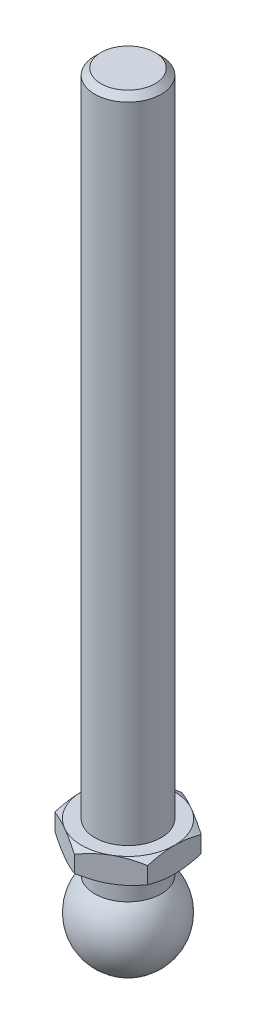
ISO-10303-21;
HEADER;
FILE_DESCRIPTION(('STEP AP214'),'2;1');
FILE_NAME('part.step','',(''),(''),'','','');
FILE_SCHEMA(('AUTOMOTIVE_DESIGN { 1 0 10303 214 1 1 1 1 }'));
ENDSEC;
DATA;
#1=APPLICATION_CONTEXT('core data for automotive mechanical design processes');
#2=APPLICATION_PROTOCOL_DEFINITION('international standard','automotive_design',2000,#1);
#3=PRODUCT_CONTEXT('',#1,'mechanical');
#4=PRODUCT('Part','Part','',(#3));
#5=PRODUCT_RELATED_PRODUCT_CATEGORY('part','',(#4));
#6=PRODUCT_DEFINITION_FORMATION('','',#4);
#7=PRODUCT_DEFINITION_CONTEXT('part definition',#1,'design');
#8=PRODUCT_DEFINITION('design','',#6,#7);
#9=PRODUCT_DEFINITION_SHAPE('','',#8);
#10=(LENGTH_UNIT() NAMED_UNIT(*) SI_UNIT(.MILLI.,.METRE.));
#11=(NAMED_UNIT(*) PLANE_ANGLE_UNIT() SI_UNIT($,.RADIAN.));
#12=(NAMED_UNIT(*) SI_UNIT($,.STERADIAN.) SOLID_ANGLE_UNIT());
#13=UNCERTAINTY_MEASURE_WITH_UNIT(LENGTH_MEASURE(1.E-05),#10,'distance_accuracy_value','');
#14=(GEOMETRIC_REPRESENTATION_CONTEXT(3) GLOBAL_UNCERTAINTY_ASSIGNED_CONTEXT((#13)) GLOBAL_UNIT_ASSIGNED_CONTEXT((#10,
#11,#12)) REPRESENTATION_CONTEXT('',''));
#15=CARTESIAN_POINT('',(0.,0.,0.));
#16=DIRECTION('',(0.,0.,1.));
#17=DIRECTION('',(1.,0.,0.));
#18=AXIS2_PLACEMENT_3D('',#15,#16,#17);
#19=CARTESIAN_POINT('',(0.,12.25,0.));
#20=DIRECTION('',(0.,-1.,0.));
#21=DIRECTION('',(0.,0.,-1.));
#22=AXIS2_PLACEMENT_3D('',#19,#20,#21);
#23=CONICAL_SURFACE('',#22,7.,1.0471975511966);
#24=CARTESIAN_POINT('',(-7.,8.18828268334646,12.1648696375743));
#25=CARTESIAN_POINT('',(-7.,8.33391573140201,11.8738003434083));
#26=CARTESIAN_POINT('',(-7.,8.47854589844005,11.5822239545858));
#27=CARTESIAN_POINT('',(-7.,8.76531569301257,10.997825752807));
#28=CARTESIAN_POINT('',(-7.,8.90745515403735,10.7050038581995));
#29=CARTESIAN_POINT('',(-7.,9.18902214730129,10.1173316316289));
#30=CARTESIAN_POINT('',(-7.,9.32844364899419,9.82247840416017));
#31=CARTESIAN_POINT('',(-7.,9.6036060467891,9.23106328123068));
#32=CARTESIAN_POINT('',(-7.,9.73934701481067,8.93450141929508));
#33=CARTESIAN_POINT('',(-7.,10.0123110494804,8.32593520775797));
#34=CARTESIAN_POINT('',(-7.,10.1493254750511,8.01383696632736));
#35=CARTESIAN_POINT('',(-7.,10.4171383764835,7.38695797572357));
#36=CARTESIAN_POINT('',(-7.,10.5479365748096,7.07217710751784));
#37=CARTESIAN_POINT('',(-7.,10.8015530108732,6.43962449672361));
#38=CARTESIAN_POINT('',(-7.,10.924376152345,6.12185473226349));
#39=CARTESIAN_POINT('',(-7.,11.1599016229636,5.48260317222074));
#40=CARTESIAN_POINT('',(-7.,11.2726050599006,5.16112178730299));
#41=CARTESIAN_POINT('',(-7.,11.5099014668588,4.43821731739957));
#42=CARTESIAN_POINT('',(-7.,11.631118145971,4.03566892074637));
#43=CARTESIAN_POINT('',(-7.,11.8469740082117,3.22331060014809));
#44=CARTESIAN_POINT('',(-7.,11.9416155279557,2.81350131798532));
#45=CARTESIAN_POINT('',(-7.,12.0569999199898,2.19742561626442));
#46=CARTESIAN_POINT('',(-7.,12.0908518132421,1.99359214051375));
#47=CARTESIAN_POINT('',(-7.,12.1493191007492,1.58461613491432));
#48=CARTESIAN_POINT('',(-7.,12.1739358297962,1.3794737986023));
#49=CARTESIAN_POINT('',(-7.,12.2131968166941,0.968289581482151));
#50=CARTESIAN_POINT('',(-7.,12.2278439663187,0.762247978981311));
#51=CARTESIAN_POINT('',(-7.,12.2467021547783,0.34968332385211));
#52=CARTESIAN_POINT('',(-7.,12.2509132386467,0.143160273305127));
#53=CARTESIAN_POINT('',(-7.,12.2487493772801,-0.27108276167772));
#54=CARTESIAN_POINT('',(-7.,12.2423100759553,-0.478802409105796));
#55=CARTESIAN_POINT('',(-7.,12.2189433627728,-0.89364512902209));
#56=CARTESIAN_POINT('',(-7.,12.2020159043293,-1.10076819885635));
#57=CARTESIAN_POINT('',(-7.,12.1582124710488,-1.51403043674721));
#58=CARTESIAN_POINT('',(-7.,12.1313327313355,-1.72016920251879));
#59=CARTESIAN_POINT('',(-7.,12.0684180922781,-2.13103319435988));
#60=CARTESIAN_POINT('',(-7.,12.0323828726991,-2.33575837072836));
#61=CARTESIAN_POINT('',(-7.,11.9105686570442,-2.95437912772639));
#62=CARTESIAN_POINT('',(-7.,11.8118729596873,-3.36575077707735));
#63=CARTESIAN_POINT('',(-7.,11.58845338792,-4.18138012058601));
#64=CARTESIAN_POINT('',(-7.,11.4637148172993,-4.58563365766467));
#65=CARTESIAN_POINT('',(-7.,11.2233248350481,-5.30320893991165));
#66=CARTESIAN_POINT('',(-7.,11.1112875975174,-5.61775957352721));
#67=CARTESIAN_POINT('',(-7.,10.8778514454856,-6.2432502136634));
#68=CARTESIAN_POINT('',(-7.,10.7564551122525,-6.55419118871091));
#69=CARTESIAN_POINT('',(-7.,10.5062070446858,-7.1732852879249));
#70=CARTESIAN_POINT('',(-7.,10.3773503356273,-7.4814363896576));
#71=CARTESIAN_POINT('',(-7.,10.1137823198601,-8.09523802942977));
#72=CARTESIAN_POINT('',(-7.,9.97907065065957,-8.4008884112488));
#73=CARTESIAN_POINT('',(-7.,9.71078407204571,-8.9971634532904));
#74=CARTESIAN_POINT('',(-7.,9.57740317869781,-9.28787568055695));
#75=CARTESIAN_POINT('',(-7.,9.30714715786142,-9.86766295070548));
#76=CARTESIAN_POINT('',(-7.,9.17027208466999,-10.1567380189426));
#77=CARTESIAN_POINT('',(-7.,8.89389786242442,-10.7329937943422));
#78=CARTESIAN_POINT('',(-7.,8.75440383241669,-11.0201769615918));
#79=CARTESIAN_POINT('',(-7.,8.47302286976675,-11.5933594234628));
#80=CARTESIAN_POINT('',(-7.,8.33113600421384,-11.879358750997));
#81=CARTESIAN_POINT('',(-7.,8.18828268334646,-12.1648696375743));
#82=B_SPLINE_CURVE_WITH_KNOTS('',3,(#24,#25,#26,#27,#28,#29,#30,#31,#32,#33,#34,#35,#36,#37,#38,
#39,#40,#41,#42,#43,#44,#45,#46,#47,#48,#49,#50,#51,#52,#53,#54,#55,#56,#57,#58,#59,#60,#61,#62,
#63,#64,#65,#66,#67,#68,#69,#70,#71,#72,#73,#74,#75,#76,#77,#78,#79,#80,#81),.UNSPECIFIED.,.F.,
.F.,(4,2,2,2,2,2,2,2,2,2,2,2,2,2,2,2,2,2,2,2,2,2,2,2,2,2,2,2,4),(0.,0.976413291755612,
1.95289161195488,2.93133423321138,3.90975772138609,4.93225217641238,5.95479223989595,
6.97669748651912,7.99849072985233,9.25906449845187,10.519527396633,11.1392271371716,
11.7588372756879,12.3782676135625,12.9976952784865,13.6208795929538,14.2440666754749,
14.8674897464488,15.4909346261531,16.7587972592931,18.0273773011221,19.0289263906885,
20.0302002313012,21.0321496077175,22.0341611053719,22.9936838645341,23.9531917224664,
24.9109871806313,25.8687558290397),.UNSPECIFIED.);
#83=CARTESIAN_POINT('',(-7.,11.6247852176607,4.04145188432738));
#84=VERTEX_POINT('',#83);
#85=CARTESIAN_POINT('',(-7.,12.25,0.));
#86=VERTEX_POINT('',#85);
#87=EDGE_CURVE('E312',#84,#86,#82,.T.);
#88=ORIENTED_EDGE('',*,*,#87,.F.);
#89=CARTESIAN_POINT('',(0.0002,11.6247185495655,8.0830192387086));
#90=CARTESIAN_POINT('',(-0.153667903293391,11.6760001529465,7.99418356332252));
#91=CARTESIAN_POINT('',(-0.30810950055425,11.7249544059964,7.90501666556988));
#92=CARTESIAN_POINT('',(-0.618246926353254,11.8175672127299,7.72595873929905));
#93=CARTESIAN_POINT('',(-0.773943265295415,11.8612234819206,7.63606741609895));
#94=CARTESIAN_POINT('',(-1.24352516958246,11.9833884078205,7.36495417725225));
#95=CARTESIAN_POINT('',(-1.5592643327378,12.052874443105,7.18266208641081));
#96=CARTESIAN_POINT('',(-2.03176224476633,12.1343550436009,6.9098652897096));
#97=CARTESIAN_POINT('',(-2.18710922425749,12.1575665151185,6.82017566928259));
#98=CARTESIAN_POINT('',(-2.49850511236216,12.1964887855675,6.64039116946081));
#99=CARTESIAN_POINT('',(-2.65455395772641,12.2122002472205,6.55029632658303));
#100=CARTESIAN_POINT('',(-2.96692267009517,12.2357220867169,6.36995016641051));
#101=CARTESIAN_POINT('',(-3.12324202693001,12.2435414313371,6.27969914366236));
#102=CARTESIAN_POINT('',(-3.43601650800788,12.2511197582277,6.09911871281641));
#103=CARTESIAN_POINT('',(-3.59247162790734,12.250878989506,6.00878930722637));
#104=CARTESIAN_POINT('',(-4.02110687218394,12.2391402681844,5.76131663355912));
#105=CARTESIAN_POINT('',(-4.2931466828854,12.2194342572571,5.60425437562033));
#106=CARTESIAN_POINT('',(-4.8354194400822,12.1569465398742,5.29117305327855));
#107=CARTESIAN_POINT('',(-5.10565047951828,12.114143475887,5.13515508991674));
#108=CARTESIAN_POINT('',(-5.64901454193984,12.0071483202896,4.82144370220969));
#109=CARTESIAN_POINT('',(-5.92207900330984,11.9425029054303,4.66378986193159));
#110=CARTESIAN_POINT('',(-6.46413578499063,11.795783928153,4.35083323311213));
#111=CARTESIAN_POINT('',(-6.73313504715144,11.7137448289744,4.19552643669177));
#112=CARTESIAN_POINT('',(-7.0002,11.6247185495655,4.04133641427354));
#113=B_SPLINE_CURVE_WITH_KNOTS('',3,(#89,#90,#91,#92,#93,#94,#95,#96,#97,#98,#99,#100,#101,#102,
#103,#104,#105,#106,#107,#108,#109,#110,#111,#112),.UNSPECIFIED.,.F.,.F.,(4,2,2,2,2,2,2,2,2,2,2,
4),(0.,0.554727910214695,1.10969417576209,2.2219327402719,2.76443041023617,3.30688013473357,
3.8487128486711,4.39052882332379,5.33376515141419,6.27787517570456,7.2429241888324,
8.20607866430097),.UNSPECIFIED.);
#114=CARTESIAN_POINT('',(-3.5,12.25,6.06217782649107));
#115=VERTEX_POINT('',#114);
#116=EDGE_CURVE('E138',#115,#84,#113,.T.);
#117=ORIENTED_EDGE('',*,*,#116,.F.);
#118=CARTESIAN_POINT('',(0.,12.25,0.));
#119=DIRECTION('',(0.,-1.,0.));
#120=DIRECTION('',(0.,0.,-1.));
#121=AXIS2_PLACEMENT_3D('',#118,#119,#120);
#122=CIRCLE('',#121,7.);
#123=EDGE_CURVE('E286',#115,#86,#122,.T.);
#124=ORIENTED_EDGE('',*,*,#123,.T.);
#125=EDGE_LOOP('',(#88,#117,#124));
#126=FACE_BOUND('',#125,.T.);
#127=ADVANCED_FACE('F17',(#126),#23,.T.);
#128=CARTESIAN_POINT('',(-7.,11.6247852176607,-4.04145188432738));
#129=VERTEX_POINT('',#128);
#130=EDGE_CURVE('E196',#86,#129,#82,.T.);
#131=ORIENTED_EDGE('',*,*,#130,.F.);
#132=CARTESIAN_POINT('',(-3.5,12.25,-6.06217782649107));
#133=VERTEX_POINT('',#132);
#134=EDGE_CURVE('E198',#86,#133,#122,.T.);
#135=ORIENTED_EDGE('',*,*,#134,.T.);
#136=CARTESIAN_POINT('',(-7.0002,11.6247185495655,-4.04133641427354));
#137=CARTESIAN_POINT('',(-6.84633209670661,11.6760001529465,-4.13017208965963));
#138=CARTESIAN_POINT('',(-6.69189049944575,11.7249544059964,-4.21933898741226));
#139=CARTESIAN_POINT('',(-6.38175307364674,11.8175672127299,-4.39839691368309));
#140=CARTESIAN_POINT('',(-6.22605673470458,11.8612234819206,-4.48828823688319));
#141=CARTESIAN_POINT('',(-5.75647483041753,11.9833884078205,-4.75940147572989));
#142=CARTESIAN_POINT('',(-5.4407356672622,12.052874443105,-4.94169356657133));
#143=CARTESIAN_POINT('',(-4.96823775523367,12.1343550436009,-5.21449036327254));
#144=CARTESIAN_POINT('',(-4.81289077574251,12.1575665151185,-5.30417998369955));
#145=CARTESIAN_POINT('',(-4.50149488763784,12.1964887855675,-5.48396448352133));
#146=CARTESIAN_POINT('',(-4.34544604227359,12.2122002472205,-5.57405932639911));
#147=CARTESIAN_POINT('',(-4.03307732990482,12.2357220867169,-5.75440548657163));
#148=CARTESIAN_POINT('',(-3.87675797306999,12.2435414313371,-5.84465650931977));
#149=CARTESIAN_POINT('',(-3.56398349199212,12.2511197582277,-6.02523694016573));
#150=CARTESIAN_POINT('',(-3.40752837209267,12.250878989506,-6.11556634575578));
#151=CARTESIAN_POINT('',(-2.97889312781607,12.2391402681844,-6.36303901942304));
#152=CARTESIAN_POINT('',(-2.7068533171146,12.2194342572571,-6.52010127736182));
#153=CARTESIAN_POINT('',(-2.1645805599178,12.1569465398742,-6.83318259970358));
#154=CARTESIAN_POINT('',(-1.89434952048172,12.114143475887,-6.9892005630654));
#155=CARTESIAN_POINT('',(-1.35098545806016,12.0071483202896,-7.30291195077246));
#156=CARTESIAN_POINT('',(-1.07792099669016,11.9425029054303,-7.46056579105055));
#157=CARTESIAN_POINT('',(-0.535864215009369,11.795783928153,-7.77352241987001));
#158=CARTESIAN_POINT('',(-0.266864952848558,11.7137448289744,-7.92882921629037));
#159=CARTESIAN_POINT('',(0.000200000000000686,11.6247185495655,-8.0830192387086));
#160=B_SPLINE_CURVE_WITH_KNOTS('',3,(#136,#137,#138,#139,#140,#141,#142,#143,#144,#145,#146,
#147,#148,#149,#150,#151,#152,#153,#154,#155,#156,#157,#158,#159),.UNSPECIFIED.,.F.,.F.,(4,2,2,
2,2,2,2,2,2,2,2,4),(0.,0.554727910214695,1.10969417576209,2.2219327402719,2.76443041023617,
3.30688013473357,3.8487128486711,4.39052882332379,5.33376515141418,6.27787517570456,
7.2429241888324,8.20607866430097),.UNSPECIFIED.);
#161=EDGE_CURVE('E186',#129,#133,#160,.T.);
#162=ORIENTED_EDGE('',*,*,#161,.F.);
#163=EDGE_LOOP('',(#131,#135,#162));
#164=FACE_BOUND('',#163,.T.);
#165=ADVANCED_FACE('F195',(#164),#23,.T.);
#166=CARTESIAN_POINT('',(0.,11.6247852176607,-8.08290376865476));
#167=VERTEX_POINT('',#166);
#168=EDGE_CURVE('E200',#133,#167,#160,.T.);
#169=ORIENTED_EDGE('',*,*,#168,.F.);
#170=CARTESIAN_POINT('',(3.5,12.25,-6.06217782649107));
#171=VERTEX_POINT('',#170);
#172=EDGE_CURVE('E296',#133,#171,#122,.T.);
#173=ORIENTED_EDGE('',*,*,#172,.T.);
#174=CARTESIAN_POINT('',(-0.0002,11.6247185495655,-8.0830192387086));
#175=CARTESIAN_POINT('',(0.153667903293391,11.6760001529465,-7.99418356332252));
#176=CARTESIAN_POINT('',(0.30810950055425,11.7249544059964,-7.90501666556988));
#177=CARTESIAN_POINT('',(0.618246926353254,11.8175672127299,-7.72595873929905));
#178=CARTESIAN_POINT('',(0.773943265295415,11.8612234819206,-7.63606741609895));
#179=CARTESIAN_POINT('',(1.24352516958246,11.9833884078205,-7.36495417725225));
#180=CARTESIAN_POINT('',(1.5592643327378,12.052874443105,-7.18266208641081));
#181=CARTESIAN_POINT('',(2.03176224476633,12.1343550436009,-6.9098652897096));
#182=CARTESIAN_POINT('',(2.18710922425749,12.1575665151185,-6.82017566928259));
#183=CARTESIAN_POINT('',(2.49850511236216,12.1964887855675,-6.64039116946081));
#184=CARTESIAN_POINT('',(2.65455395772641,12.2122002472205,-6.55029632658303));
#185=CARTESIAN_POINT('',(2.96692267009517,12.2357220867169,-6.36995016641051));
#186=CARTESIAN_POINT('',(3.12324202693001,12.2435414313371,-6.27969914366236));
#187=CARTESIAN_POINT('',(3.43601650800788,12.2511197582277,-6.09911871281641));
#188=CARTESIAN_POINT('',(3.59247162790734,12.250878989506,-6.00878930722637));
#189=CARTESIAN_POINT('',(4.02110687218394,12.2391402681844,-5.76131663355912));
#190=CARTESIAN_POINT('',(4.2931466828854,12.2194342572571,-5.60425437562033));
#191=CARTESIAN_POINT('',(4.8354194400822,12.1569465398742,-5.29117305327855));
#192=CARTESIAN_POINT('',(5.10565047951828,12.114143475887,-5.13515508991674));
#193=CARTESIAN_POINT('',(5.64901454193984,12.0071483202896,-4.82144370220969));
#194=CARTESIAN_POINT('',(5.92207900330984,11.9425029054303,-4.66378986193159));
#195=CARTESIAN_POINT('',(6.46413578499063,11.795783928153,-4.35083323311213));
#196=CARTESIAN_POINT('',(6.73313504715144,11.7137448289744,-4.19552643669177));
#197=CARTESIAN_POINT('',(7.0002,11.6247185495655,-4.04133641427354));
#198=B_SPLINE_CURVE_WITH_KNOTS('',3,(#174,#175,#176,#177,#178,#179,#180,#181,#182,#183,#184,
#185,#186,#187,#188,#189,#190,#191,#192,#193,#194,#195,#196,#197),.UNSPECIFIED.,.F.,.F.,(4,2,2,
2,2,2,2,2,2,2,2,4),(0.,0.554727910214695,1.10969417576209,2.2219327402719,2.76443041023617,
3.30688013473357,3.8487128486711,4.39052882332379,5.33376515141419,6.27787517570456,
7.2429241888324,8.20607866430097),.UNSPECIFIED.);
#199=EDGE_CURVE('E246',#167,#171,#198,.T.);
#200=ORIENTED_EDGE('',*,*,#199,.F.);
#201=EDGE_LOOP('',(#169,#173,#200));
#202=FACE_BOUND('',#201,.T.);
#203=ADVANCED_FACE('F345',(#202),#23,.T.);
#204=CARTESIAN_POINT('',(7.,11.6247852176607,-4.04145188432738));
#205=VERTEX_POINT('',#204);
#206=EDGE_CURVE('E241',#171,#205,#198,.T.);
#207=ORIENTED_EDGE('',*,*,#206,.F.);
#208=CARTESIAN_POINT('',(7.,12.25,0.));
#209=VERTEX_POINT('',#208);
#210=EDGE_CURVE('E291',#171,#209,#122,.T.);
#211=ORIENTED_EDGE('',*,*,#210,.T.);
#212=CARTESIAN_POINT('',(7.,8.18828268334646,-12.1648696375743));
#213=CARTESIAN_POINT('',(7.,8.33391573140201,-11.8738003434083));
#214=CARTESIAN_POINT('',(7.,8.47854589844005,-11.5822239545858));
#215=CARTESIAN_POINT('',(7.,8.76531569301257,-10.997825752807));
#216=CARTESIAN_POINT('',(7.,8.90745515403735,-10.7050038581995));
#217=CARTESIAN_POINT('',(7.,9.18902214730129,-10.1173316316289));
#218=CARTESIAN_POINT('',(7.,9.32844364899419,-9.82247840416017));
#219=CARTESIAN_POINT('',(7.,9.6036060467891,-9.23106328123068));
#220=CARTESIAN_POINT('',(7.,9.73934701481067,-8.93450141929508));
#221=CARTESIAN_POINT('',(7.,10.0123110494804,-8.32593520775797));
#222=CARTESIAN_POINT('',(7.,10.1493254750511,-8.01383696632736));
#223=CARTESIAN_POINT('',(7.,10.4171383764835,-7.38695797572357));
#224=CARTESIAN_POINT('',(7.,10.5479365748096,-7.07217710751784));
#225=CARTESIAN_POINT('',(7.,10.8015530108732,-6.43962449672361));
#226=CARTESIAN_POINT('',(7.,10.924376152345,-6.12185473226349));
#227=CARTESIAN_POINT('',(7.,11.1599016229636,-5.48260317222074));
#228=CARTESIAN_POINT('',(7.,11.2726050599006,-5.16112178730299));
#229=CARTESIAN_POINT('',(7.,11.5099014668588,-4.43821731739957));
#230=CARTESIAN_POINT('',(7.,11.631118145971,-4.03566892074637));
#231=CARTESIAN_POINT('',(7.,11.8469740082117,-3.22331060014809));
#232=CARTESIAN_POINT('',(7.,11.9416155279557,-2.81350131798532));
#233=CARTESIAN_POINT('',(7.,12.0569999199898,-2.19742561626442));
#234=CARTESIAN_POINT('',(7.,12.0908518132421,-1.99359214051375));
#235=CARTESIAN_POINT('',(7.,12.1493191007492,-1.58461613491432));
#236=CARTESIAN_POINT('',(7.,12.1739358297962,-1.3794737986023));
#237=CARTESIAN_POINT('',(7.,12.2131968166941,-0.968289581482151));
#238=CARTESIAN_POINT('',(7.,12.2278439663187,-0.762247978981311));
#239=CARTESIAN_POINT('',(7.,12.2467021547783,-0.34968332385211));
#240=CARTESIAN_POINT('',(7.,12.2509132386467,-0.143160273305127));
#241=CARTESIAN_POINT('',(7.,12.2487493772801,0.27108276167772));
#242=CARTESIAN_POINT('',(7.,12.2423100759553,0.478802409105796));
#243=CARTESIAN_POINT('',(7.,12.2189433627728,0.89364512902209));
#244=CARTESIAN_POINT('',(7.,12.2020159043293,1.10076819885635));
#245=CARTESIAN_POINT('',(7.,12.1582124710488,1.51403043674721));
#246=CARTESIAN_POINT('',(7.,12.1313327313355,1.72016920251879));
#247=CARTESIAN_POINT('',(7.,12.0684180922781,2.13103319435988));
#248=CARTESIAN_POINT('',(7.,12.0323828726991,2.33575837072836));
#249=CARTESIAN_POINT('',(7.,11.9105686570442,2.95437912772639));
#250=CARTESIAN_POINT('',(7.,11.8118729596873,3.36575077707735));
#251=CARTESIAN_POINT('',(7.,11.58845338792,4.18138012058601));
#252=CARTESIAN_POINT('',(7.,11.4637148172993,4.58563365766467));
#253=CARTESIAN_POINT('',(7.,11.2233248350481,5.30320893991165));
#254=CARTESIAN_POINT('',(7.,11.1112875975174,5.61775957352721));
#255=CARTESIAN_POINT('',(7.,10.8778514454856,6.2432502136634));
#256=CARTESIAN_POINT('',(7.,10.7564551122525,6.55419118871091));
#257=CARTESIAN_POINT('',(7.,10.5062070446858,7.1732852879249));
#258=CARTESIAN_POINT('',(7.,10.3773503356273,7.4814363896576));
#259=CARTESIAN_POINT('',(7.,10.1137823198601,8.09523802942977));
#260=CARTESIAN_POINT('',(7.,9.97907065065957,8.4008884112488));
#261=CARTESIAN_POINT('',(7.,9.71078407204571,8.9971634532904));
#262=CARTESIAN_POINT('',(7.,9.57740317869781,9.28787568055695));
#263=CARTESIAN_POINT('',(7.,9.30714715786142,9.86766295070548));
#264=CARTESIAN_POINT('',(7.,9.17027208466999,10.1567380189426));
#265=CARTESIAN_POINT('',(7.,8.89389786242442,10.7329937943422));
#266=CARTESIAN_POINT('',(7.,8.75440383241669,11.0201769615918));
#267=CARTESIAN_POINT('',(7.,8.47302286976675,11.5933594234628));
#268=CARTESIAN_POINT('',(7.,8.33113600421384,11.879358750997));
#269=CARTESIAN_POINT('',(7.,8.18828268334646,12.1648696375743));
#270=B_SPLINE_CURVE_WITH_KNOTS('',3,(#212,#213,#214,#215,#216,#217,#218,#219,#220,#221,#222,
#223,#224,#225,#226,#227,#228,#229,#230,#231,#232,#233,#234,#235,#236,#237,#238,#239,#240,#241,
#242,#243,#244,#245,#246,#247,#248,#249,#250,#251,#252,#253,#254,#255,#256,#257,#258,#259,#260,
#261,#262,#263,#264,#265,#266,#267,#268,#269),.UNSPECIFIED.,.F.,.F.,(4,2,2,2,2,2,2,2,2,2,2,2,2,
2,2,2,2,2,2,2,2,2,2,2,2,2,2,2,4),(0.,0.976413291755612,1.95289161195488,2.93133423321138,
3.90975772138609,4.93225217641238,5.95479223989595,6.97669748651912,7.99849072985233,
9.25906449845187,10.519527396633,11.1392271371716,11.7588372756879,12.3782676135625,
12.9976952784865,13.6208795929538,14.2440666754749,14.8674897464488,15.4909346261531,
16.7587972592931,18.0273773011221,19.0289263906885,20.0302002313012,21.0321496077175,
22.0341611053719,22.9936838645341,23.9531917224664,24.9109871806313,25.8687558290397),.UNSPECIFIED.);
#271=EDGE_CURVE('E252',#205,#209,#270,.T.);
#272=ORIENTED_EDGE('',*,*,#271,.F.);
#273=EDGE_LOOP('',(#207,#211,#272));
#274=FACE_BOUND('',#273,.T.);
#275=ADVANCED_FACE('F355',(#274),#23,.T.);
#276=CARTESIAN_POINT('',(7.,11.6247852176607,4.04145188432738));
#277=VERTEX_POINT('',#276);
#278=EDGE_CURVE('E254',#209,#277,#270,.T.);
#279=ORIENTED_EDGE('',*,*,#278,.F.);
#280=CARTESIAN_POINT('',(3.5,12.25,6.06217782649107));
#281=VERTEX_POINT('',#280);
#282=EDGE_CURVE('E284',#209,#281,#122,.T.);
#283=ORIENTED_EDGE('',*,*,#282,.T.);
#284=CARTESIAN_POINT('',(7.0002,11.6247185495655,4.04133641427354));
#285=CARTESIAN_POINT('',(6.84633209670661,11.6760001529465,4.13017208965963));
#286=CARTESIAN_POINT('',(6.69189049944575,11.7249544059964,4.21933898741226));
#287=CARTESIAN_POINT('',(6.38175307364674,11.8175672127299,4.39839691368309));
#288=CARTESIAN_POINT('',(6.22605673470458,11.8612234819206,4.48828823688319));
#289=CARTESIAN_POINT('',(5.75647483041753,11.9833884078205,4.75940147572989));
#290=CARTESIAN_POINT('',(5.4407356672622,12.052874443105,4.94169356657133));
#291=CARTESIAN_POINT('',(4.96823775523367,12.1343550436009,5.21449036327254));
#292=CARTESIAN_POINT('',(4.81289077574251,12.1575665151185,5.30417998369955));
#293=CARTESIAN_POINT('',(4.50149488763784,12.1964887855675,5.48396448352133));
#294=CARTESIAN_POINT('',(4.34544604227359,12.2122002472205,5.57405932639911));
#295=CARTESIAN_POINT('',(4.03307732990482,12.2357220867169,5.75440548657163));
#296=CARTESIAN_POINT('',(3.87675797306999,12.2435414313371,5.84465650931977));
#297=CARTESIAN_POINT('',(3.56398349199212,12.2511197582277,6.02523694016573));
#298=CARTESIAN_POINT('',(3.40752837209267,12.250878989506,6.11556634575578));
#299=CARTESIAN_POINT('',(2.97889312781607,12.2391402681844,6.36303901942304));
#300=CARTESIAN_POINT('',(2.7068533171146,12.2194342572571,6.52010127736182));
#301=CARTESIAN_POINT('',(2.1645805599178,12.1569465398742,6.83318259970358));
#302=CARTESIAN_POINT('',(1.89434952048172,12.114143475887,6.9892005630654));
#303=CARTESIAN_POINT('',(1.35098545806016,12.0071483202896,7.30291195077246));
#304=CARTESIAN_POINT('',(1.07792099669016,11.9425029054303,7.46056579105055));
#305=CARTESIAN_POINT('',(0.535864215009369,11.795783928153,7.77352241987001));
#306=CARTESIAN_POINT('',(0.266864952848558,11.7137448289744,7.92882921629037));
#307=CARTESIAN_POINT('',(-0.000200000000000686,11.6247185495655,8.0830192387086));
#308=B_SPLINE_CURVE_WITH_KNOTS('',3,(#284,#285,#286,#287,#288,#289,#290,#291,#292,#293,#294,
#295,#296,#297,#298,#299,#300,#301,#302,#303,#304,#305,#306,#307),.UNSPECIFIED.,.F.,.F.,(4,2,2,
2,2,2,2,2,2,2,2,4),(0.,0.554727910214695,1.10969417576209,2.2219327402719,2.76443041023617,
3.30688013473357,3.8487128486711,4.39052882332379,5.33376515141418,6.27787517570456,
7.2429241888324,8.20607866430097),.UNSPECIFIED.);
#309=EDGE_CURVE('E129',#277,#281,#308,.T.);
#310=ORIENTED_EDGE('',*,*,#309,.F.);
#311=EDGE_LOOP('',(#279,#283,#310));
#312=FACE_BOUND('',#311,.T.);
#313=ADVANCED_FACE('F288',(#312),#23,.T.);
#314=CARTESIAN_POINT('',(0.,11.6247852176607,8.08290376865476));
#315=VERTEX_POINT('',#314);
#316=EDGE_CURVE('E119',#281,#315,#308,.T.);
#317=ORIENTED_EDGE('',*,*,#316,.F.);
#318=EDGE_CURVE('E277',#281,#115,#122,.T.);
#319=ORIENTED_EDGE('',*,*,#318,.T.);
#320=EDGE_CURVE('E32',#315,#115,#113,.T.);
#321=ORIENTED_EDGE('',*,*,#320,.F.);
#322=EDGE_LOOP('',(#317,#319,#321));
#323=FACE_BOUND('',#322,.T.);
#324=ADVANCED_FACE('F276',(#323),#23,.T.);
#325=CARTESIAN_POINT('',(0.,110.25,0.));
#326=DIRECTION('',(0.,-1.,0.));
#327=DIRECTION('',(0.,0.,-1.));
#328=AXIS2_PLACEMENT_3D('',#325,#326,#327);
#329=PLANE('',#328);
#330=CARTESIAN_POINT('',(0.,110.25,0.));
#331=DIRECTION('',(0.,-1.,0.));
#332=DIRECTION('',(0.,0.,-1.));
#333=AXIS2_PLACEMENT_3D('',#330,#331,#332);
#334=CIRCLE('',#333,4.08);
#335=CARTESIAN_POINT('',(0.,110.25,-4.08));
#336=VERTEX_POINT('',#335);
#337=EDGE_CURVE('E25',#336,#336,#334,.T.);
#338=ORIENTED_EDGE('',*,*,#337,.F.);
#339=EDGE_LOOP('',(#338));
#340=FACE_BOUND('',#339,.T.);
#341=ADVANCED_FACE('F19',(#340),#329,.F.);
#342=CARTESIAN_POINT('',(0.,110.25,0.));
#343=DIRECTION('',(0.,-1.,0.));
#344=DIRECTION('',(0.,0.,-1.));
#345=AXIS2_PLACEMENT_3D('',#342,#343,#344);
#346=CONICAL_SURFACE('',#345,4.08,0.785398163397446);
#347=CARTESIAN_POINT('',(0.,109.33,0.));
#348=DIRECTION('',(0.,-1.,0.));
#349=DIRECTION('',(0.,0.,-1.));
#350=AXIS2_PLACEMENT_3D('',#347,#348,#349);
#351=CIRCLE('',#350,5.);
#352=CARTESIAN_POINT('',(0.,109.33,-5.));
#353=VERTEX_POINT('',#352);
#354=EDGE_CURVE('E293',#353,#353,#351,.T.);
#355=ORIENTED_EDGE('',*,*,#354,.F.);
#356=EDGE_LOOP('',(#355));
#357=FACE_BOUND('',#356,.T.);
#358=ORIENTED_EDGE('',*,*,#337,.T.);
#359=EDGE_LOOP('',(#358));
#360=FACE_BOUND('',#359,.T.);
#361=ADVANCED_FACE('F353',(#357,#360),#346,.T.);
#362=CARTESIAN_POINT('',(0.,-7.,0.));
#363=DIRECTION('',(0.,-1.,0.));
#364=DIRECTION('',(0.,0.,-1.));
#365=AXIS2_PLACEMENT_3D('',#362,#363,#364);
#366=CYLINDRICAL_SURFACE('',#365,5.);
#367=CARTESIAN_POINT('',(0.,12.25,0.));
#368=DIRECTION('',(0.,-1.,0.));
#369=DIRECTION('',(0.,0.,-1.));
#370=AXIS2_PLACEMENT_3D('',#367,#368,#369);
#371=CIRCLE('',#370,5.);
#372=CARTESIAN_POINT('',(0.,12.25,-5.));
#373=VERTEX_POINT('',#372);
#374=EDGE_CURVE('E290',#373,#373,#371,.T.);
#375=ORIENTED_EDGE('',*,*,#374,.F.);
#376=EDGE_LOOP('',(#375));
#377=FACE_BOUND('',#376,.T.);
#378=ORIENTED_EDGE('',*,*,#354,.T.);
#379=EDGE_LOOP('',(#378));
#380=FACE_BOUND('',#379,.T.);
#381=ADVANCED_FACE('F430',(#377,#380),#366,.T.);
#382=CARTESIAN_POINT('',(5.,12.25,0.));
#383=DIRECTION('',(0.,-1.,0.));
#384=DIRECTION('',(0.,0.,-1.));
#385=AXIS2_PLACEMENT_3D('',#382,#383,#384);
#386=PLANE('',#385);
#387=ORIENTED_EDGE('',*,*,#282,.F.);
#388=ORIENTED_EDGE('',*,*,#210,.F.);
#389=ORIENTED_EDGE('',*,*,#172,.F.);
#390=ORIENTED_EDGE('',*,*,#134,.F.);
#391=ORIENTED_EDGE('',*,*,#123,.F.);
#392=ORIENTED_EDGE('',*,*,#318,.F.);
#393=EDGE_LOOP('',(#387,#388,#389,#390,#391,#392));
#394=FACE_BOUND('',#393,.T.);
#395=ORIENTED_EDGE('',*,*,#374,.T.);
#396=EDGE_LOOP('',(#395));
#397=FACE_BOUND('',#396,.T.);
#398=ADVANCED_FACE('F281',(#394,#397),#386,.F.);
#399=CARTESIAN_POINT('',(-7.,8.5,-4.04145188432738));
#400=DIRECTION('',(-1.,0.,0.));
#401=DIRECTION('',(0.,0.,1.));
#402=AXIS2_PLACEMENT_3D('',#399,#400,#401);
#403=PLANE('',#402);
#404=ORIENTED_EDGE('',*,*,#87,.T.);
#405=ORIENTED_EDGE('',*,*,#130,.T.);
#406=DIRECTION('',(0.,1.,0.));
#407=VECTOR('',#406,1.);
#408=CARTESIAN_POINT('',(-7.,8.5,-4.04145188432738));
#409=LINE('',#408,#407);
#410=CARTESIAN_POINT('',(-7.,9.12521478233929,-4.04145188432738));
#411=VERTEX_POINT('',#410);
#412=EDGE_CURVE('E112',#411,#129,#409,.T.);
#413=ORIENTED_EDGE('',*,*,#412,.F.);
#414=CARTESIAN_POINT('',(-7.,12.5617173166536,-12.1648696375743));
#415=CARTESIAN_POINT('',(-7.,12.416084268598,-11.8738003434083));
#416=CARTESIAN_POINT('',(-7.,12.27145410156,-11.5822239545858));
#417=CARTESIAN_POINT('',(-7.,11.9846843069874,-10.997825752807));
#418=CARTESIAN_POINT('',(-7.,11.8425448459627,-10.7050038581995));
#419=CARTESIAN_POINT('',(-7.,11.5609778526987,-10.1173316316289));
#420=CARTESIAN_POINT('',(-7.,11.4215563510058,-9.82247840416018));
#421=CARTESIAN_POINT('',(-7.,11.1463939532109,-9.23106328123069));
#422=CARTESIAN_POINT('',(-7.,11.0106529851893,-8.93450141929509));
#423=CARTESIAN_POINT('',(-7.,10.7376889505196,-8.32593520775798));
#424=CARTESIAN_POINT('',(-7.,10.6006745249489,-8.01383696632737));
#425=CARTESIAN_POINT('',(-7.,10.3328616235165,-7.38695797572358));
#426=CARTESIAN_POINT('',(-7.,10.2020634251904,-7.07217710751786));
#427=CARTESIAN_POINT('',(-7.,9.94844698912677,-6.43962449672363));
#428=CARTESIAN_POINT('',(-7.,9.825623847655,-6.12185473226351));
#429=CARTESIAN_POINT('',(-7.,9.59009837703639,-5.48260317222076));
#430=CARTESIAN_POINT('',(-7.,9.47739494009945,-5.16112178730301));
#431=CARTESIAN_POINT('',(-7.,9.24009853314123,-4.4382173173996));
#432=CARTESIAN_POINT('',(-7.,9.11888185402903,-4.03566892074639));
#433=CARTESIAN_POINT('',(-7.,8.90302599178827,-3.22331060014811));
#434=CARTESIAN_POINT('',(-7.,8.80838447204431,-2.81350131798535));
#435=CARTESIAN_POINT('',(-7.,8.69300008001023,-2.19742561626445));
#436=CARTESIAN_POINT('',(-7.,8.65914818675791,-1.99359214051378));
#437=CARTESIAN_POINT('',(-7.,8.60068089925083,-1.58461613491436));
#438=CARTESIAN_POINT('',(-7.,8.5760641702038,-1.37947379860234));
#439=CARTESIAN_POINT('',(-7.,8.53680318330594,-0.968289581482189));
#440=CARTESIAN_POINT('',(-7.,8.52215603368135,-0.76224797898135));
#441=CARTESIAN_POINT('',(-7.,8.50329784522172,-0.349683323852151));
#442=CARTESIAN_POINT('',(-7.,8.49908676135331,-0.143160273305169));
#443=CARTESIAN_POINT('',(-7.,8.50125062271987,0.271082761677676));
#444=CARTESIAN_POINT('',(-7.,8.50768992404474,0.478802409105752));
#445=CARTESIAN_POINT('',(-7.,8.53105663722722,0.893645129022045));
#446=CARTESIAN_POINT('',(-7.,8.54798409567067,1.1007681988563));
#447=CARTESIAN_POINT('',(-7.,8.59178752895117,1.51403043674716));
#448=CARTESIAN_POINT('',(-7.,8.61866726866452,1.72016920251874));
#449=CARTESIAN_POINT('',(-7.,8.68158190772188,2.13103319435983));
#450=CARTESIAN_POINT('',(-7.,8.71761712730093,2.33575837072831));
#451=CARTESIAN_POINT('',(-7.,8.83943134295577,2.95437912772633));
#452=CARTESIAN_POINT('',(-7.,8.93812704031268,3.3657507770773));
#453=CARTESIAN_POINT('',(-7.,9.16154661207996,4.18138012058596));
#454=CARTESIAN_POINT('',(-7.,9.28628518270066,4.58563365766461));
#455=CARTESIAN_POINT('',(-7.,9.52667516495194,5.30320893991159));
#456=CARTESIAN_POINT('',(-7.,9.63871240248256,5.61775957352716));
#457=CARTESIAN_POINT('',(-7.,9.87214855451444,6.24325021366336));
#458=CARTESIAN_POINT('',(-7.,9.99354488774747,6.55419118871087));
#459=CARTESIAN_POINT('',(-7.,10.2437929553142,7.17328528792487));
#460=CARTESIAN_POINT('',(-7.,10.3726496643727,7.48143638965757));
#461=CARTESIAN_POINT('',(-7.,10.6362176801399,8.09523802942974));
#462=CARTESIAN_POINT('',(-7.,10.7709293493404,8.40088841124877));
#463=CARTESIAN_POINT('',(-7.,11.0392159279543,8.99716345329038));
#464=CARTESIAN_POINT('',(-7.,11.1725968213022,9.28787568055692));
#465=CARTESIAN_POINT('',(-7.,11.4428528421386,9.86766295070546));
#466=CARTESIAN_POINT('',(-7.,11.57972791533,10.1567380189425));
#467=CARTESIAN_POINT('',(-7.,11.8561021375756,10.7329937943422));
#468=CARTESIAN_POINT('',(-7.,11.9955961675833,11.0201769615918));
#469=CARTESIAN_POINT('',(-7.,12.2769771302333,11.5933594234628));
#470=CARTESIAN_POINT('',(-7.,12.4188639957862,11.879358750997));
#471=CARTESIAN_POINT('',(-7.,12.5617173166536,12.1648696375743));
#472=B_SPLINE_CURVE_WITH_KNOTS('',3,(#414,#415,#416,#417,#418,#419,#420,#421,#422,#423,#424,
#425,#426,#427,#428,#429,#430,#431,#432,#433,#434,#435,#436,#437,#438,#439,#440,#441,#442,#443,
#444,#445,#446,#447,#448,#449,#450,#451,#452,#453,#454,#455,#456,#457,#458,#459,#460,#461,#462,
#463,#464,#465,#466,#467,#468,#469,#470,#471),.UNSPECIFIED.,.F.,.F.,(4,2,2,2,2,2,2,2,2,2,2,2,2,
2,2,2,2,2,2,2,2,2,2,2,2,2,2,2,4),(0.,0.976413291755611,1.95289161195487,2.93133423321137,
3.90975772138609,4.93225217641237,5.95479223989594,6.97669748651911,7.99849072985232,
9.25906449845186,10.5195273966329,11.1392271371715,11.7588372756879,12.3782676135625,
12.9976952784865,13.6208795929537,14.2440666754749,14.8674897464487,15.490934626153,
16.758797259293,18.0273773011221,19.0289263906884,20.0302002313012,21.0321496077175,
22.0341611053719,22.9936838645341,23.9531917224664,24.9109871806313,25.8687558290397),.UNSPECIFIED.);
#473=CARTESIAN_POINT('',(-7.,8.5,0.));
#474=VERTEX_POINT('',#473);
#475=EDGE_CURVE('E202',#411,#474,#472,.T.);
#476=ORIENTED_EDGE('',*,*,#475,.T.);
#477=CARTESIAN_POINT('',(-7.,9.12521478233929,4.04145188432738));
#478=VERTEX_POINT('',#477);
#479=EDGE_CURVE('E199',#474,#478,#472,.T.);
#480=ORIENTED_EDGE('',*,*,#479,.T.);
#481=DIRECTION('',(0.,1.,0.));
#482=VECTOR('',#481,1.);
#483=CARTESIAN_POINT('',(-7.,8.5,4.04145188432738));
#484=LINE('',#483,#482);
#485=EDGE_CURVE('E121',#478,#84,#484,.T.);
#486=ORIENTED_EDGE('',*,*,#485,.T.);
#487=EDGE_LOOP('',(#404,#405,#413,#476,#480,#486));
#488=FACE_BOUND('',#487,.T.);
#489=ADVANCED_FACE('F227',(#488),#403,.T.);
#490=CARTESIAN_POINT('',(0.,8.5,-8.08290376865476));
#491=DIRECTION('',(-0.5,0.,-0.866025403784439));
#492=DIRECTION('',(-0.866025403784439,0.,0.5));
#493=AXIS2_PLACEMENT_3D('',#490,#491,#492);
#494=PLANE('',#493);
#495=ORIENTED_EDGE('',*,*,#161,.T.);
#496=ORIENTED_EDGE('',*,*,#168,.T.);
#497=DIRECTION('',(0.,1.,0.));
#498=VECTOR('',#497,1.);
#499=CARTESIAN_POINT('',(0.,8.5,-8.08290376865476));
#500=LINE('',#499,#498);
#501=CARTESIAN_POINT('',(0.,9.12521478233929,-8.08290376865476));
#502=VERTEX_POINT('',#501);
#503=EDGE_CURVE('E178',#502,#167,#500,.T.);
#504=ORIENTED_EDGE('',*,*,#503,.F.);
#505=CARTESIAN_POINT('',(0.0002,9.1252814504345,-8.0830192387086));
#506=CARTESIAN_POINT('',(-0.153667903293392,9.07399984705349,-7.99418356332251));
#507=CARTESIAN_POINT('',(-0.308109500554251,9.02504559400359,-7.90501666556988));
#508=CARTESIAN_POINT('',(-0.618246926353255,8.93243278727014,-7.72595873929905));
#509=CARTESIAN_POINT('',(-0.773943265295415,8.88877651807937,-7.63606741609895));
#510=CARTESIAN_POINT('',(-1.24352516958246,8.7666115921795,-7.36495417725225));
#511=CARTESIAN_POINT('',(-1.5592643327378,8.69712555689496,-7.18266208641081));
#512=CARTESIAN_POINT('',(-2.03176224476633,8.6156449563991,-6.9098652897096));
#513=CARTESIAN_POINT('',(-2.18710922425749,8.59243348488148,-6.82017566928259));
#514=CARTESIAN_POINT('',(-2.49850511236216,8.55351121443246,-6.64039116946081));
#515=CARTESIAN_POINT('',(-2.65455395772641,8.53779975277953,-6.55029632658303));
#516=CARTESIAN_POINT('',(-2.96692267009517,8.51427791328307,-6.36995016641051));
#517=CARTESIAN_POINT('',(-3.12324202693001,8.50645856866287,-6.27969914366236));
#518=CARTESIAN_POINT('',(-3.43601650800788,8.49888024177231,-6.09911871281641));
#519=CARTESIAN_POINT('',(-3.59247162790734,8.49912101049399,-6.00878930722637));
#520=CARTESIAN_POINT('',(-4.02110687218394,8.5108597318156,-5.76131663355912));
#521=CARTESIAN_POINT('',(-4.2931466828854,8.53056574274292,-5.60425437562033));
#522=CARTESIAN_POINT('',(-4.83541944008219,8.59305346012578,-5.29117305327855));
#523=CARTESIAN_POINT('',(-5.10565047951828,8.63585652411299,-5.13515508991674));
#524=CARTESIAN_POINT('',(-5.64901454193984,8.74285167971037,-4.82144370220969));
#525=CARTESIAN_POINT('',(-5.92207900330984,8.80749709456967,-4.66378986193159));
#526=CARTESIAN_POINT('',(-6.46413578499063,8.95421607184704,-4.35083323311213));
#527=CARTESIAN_POINT('',(-6.73313504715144,9.03625517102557,-4.19552643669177));
#528=CARTESIAN_POINT('',(-7.0002,9.1252814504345,-4.04133641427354));
#529=B_SPLINE_CURVE_WITH_KNOTS('',3,(#505,#506,#507,#508,#509,#510,#511,#512,#513,#514,#515,
#516,#517,#518,#519,#520,#521,#522,#523,#524,#525,#526,#527,#528),.UNSPECIFIED.,.F.,.F.,(4,2,2,
2,2,2,2,2,2,2,2,4),(0.,0.554727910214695,1.10969417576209,2.2219327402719,2.76443041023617,
3.30688013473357,3.8487128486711,4.39052882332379,5.33376515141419,6.27787517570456,
7.2429241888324,8.20607866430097),.UNSPECIFIED.);
#530=CARTESIAN_POINT('',(-3.5,8.5,-6.06217782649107));
#531=VERTEX_POINT('',#530);
#532=EDGE_CURVE('E204',#502,#531,#529,.T.);
#533=ORIENTED_EDGE('',*,*,#532,.T.);
#534=EDGE_CURVE('E189',#531,#411,#529,.T.);
#535=ORIENTED_EDGE('',*,*,#534,.T.);
#536=ORIENTED_EDGE('',*,*,#412,.T.);
#537=EDGE_LOOP('',(#495,#496,#504,#533,#535,#536));
#538=FACE_BOUND('',#537,.T.);
#539=ADVANCED_FACE('F185',(#538),#494,.T.);
#540=CARTESIAN_POINT('',(7.,8.5,-4.04145188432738));
#541=DIRECTION('',(0.5,0.,-0.866025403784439));
#542=DIRECTION('',(-0.866025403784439,0.,-0.5));
#543=AXIS2_PLACEMENT_3D('',#540,#541,#542);
#544=PLANE('',#543);
#545=ORIENTED_EDGE('',*,*,#199,.T.);
#546=ORIENTED_EDGE('',*,*,#206,.T.);
#547=DIRECTION('',(0.,1.,0.));
#548=VECTOR('',#547,1.);
#549=CARTESIAN_POINT('',(7.,8.5,-4.04145188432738));
#550=LINE('',#549,#548);
#551=CARTESIAN_POINT('',(7.,9.12521478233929,-4.04145188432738));
#552=VERTEX_POINT('',#551);
#553=EDGE_CURVE('E175',#552,#205,#550,.T.);
#554=ORIENTED_EDGE('',*,*,#553,.F.);
#555=CARTESIAN_POINT('',(7.0002,9.1252814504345,-4.04133641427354));
#556=CARTESIAN_POINT('',(6.84633209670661,9.07399984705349,-4.13017208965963));
#557=CARTESIAN_POINT('',(6.69189049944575,9.02504559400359,-4.21933898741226));
#558=CARTESIAN_POINT('',(6.38175307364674,8.93243278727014,-4.39839691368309));
#559=CARTESIAN_POINT('',(6.22605673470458,8.88877651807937,-4.48828823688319));
#560=CARTESIAN_POINT('',(5.75647483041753,8.7666115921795,-4.75940147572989));
#561=CARTESIAN_POINT('',(5.4407356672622,8.69712555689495,-4.94169356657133));
#562=CARTESIAN_POINT('',(4.96823775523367,8.6156449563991,-5.21449036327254));
#563=CARTESIAN_POINT('',(4.81289077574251,8.59243348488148,-5.30417998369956));
#564=CARTESIAN_POINT('',(4.50149488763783,8.55351121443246,-5.48396448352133));
#565=CARTESIAN_POINT('',(4.34544604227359,8.53779975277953,-5.57405932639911));
#566=CARTESIAN_POINT('',(4.03307732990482,8.51427791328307,-5.75440548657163));
#567=CARTESIAN_POINT('',(3.87675797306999,8.50645856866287,-5.84465650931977));
#568=CARTESIAN_POINT('',(3.56398349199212,8.49888024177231,-6.02523694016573));
#569=CARTESIAN_POINT('',(3.40752837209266,8.49912101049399,-6.11556634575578));
#570=CARTESIAN_POINT('',(2.97889312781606,8.5108597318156,-6.36303901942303));
#571=CARTESIAN_POINT('',(2.7068533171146,8.53056574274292,-6.52010127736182));
#572=CARTESIAN_POINT('',(2.1645805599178,8.59305346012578,-6.83318259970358));
#573=CARTESIAN_POINT('',(1.89434952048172,8.63585652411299,-6.9892005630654));
#574=CARTESIAN_POINT('',(1.35098545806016,8.74285167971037,-7.30291195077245));
#575=CARTESIAN_POINT('',(1.07792099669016,8.80749709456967,-7.46056579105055));
#576=CARTESIAN_POINT('',(0.535864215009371,8.95421607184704,-7.77352241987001));
#577=CARTESIAN_POINT('',(0.26686495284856,9.03625517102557,-7.92882921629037));
#578=CARTESIAN_POINT('',(-0.000200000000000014,9.1252814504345,-8.0830192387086));
#579=B_SPLINE_CURVE_WITH_KNOTS('',3,(#555,#556,#557,#558,#559,#560,#561,#562,#563,#564,#565,
#566,#567,#568,#569,#570,#571,#572,#573,#574,#575,#576,#577,#578),.UNSPECIFIED.,.F.,.F.,(4,2,2,
2,2,2,2,2,2,2,2,4),(0.,0.554727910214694,1.10969417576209,2.2219327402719,2.76443041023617,
3.30688013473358,3.8487128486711,4.39052882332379,5.33376515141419,6.27787517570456,
7.2429241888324,8.20607866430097),.UNSPECIFIED.);
#580=CARTESIAN_POINT('',(3.5,8.5,-6.06217782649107));
#581=VERTEX_POINT('',#580);
#582=EDGE_CURVE('E247',#552,#581,#579,.T.);
#583=ORIENTED_EDGE('',*,*,#582,.T.);
#584=EDGE_CURVE('E235',#581,#502,#579,.T.);
#585=ORIENTED_EDGE('',*,*,#584,.T.);
#586=ORIENTED_EDGE('',*,*,#503,.T.);
#587=EDGE_LOOP('',(#545,#546,#554,#583,#585,#586));
#588=FACE_BOUND('',#587,.T.);
#589=ADVANCED_FACE('F226',(#588),#544,.T.);
#590=CARTESIAN_POINT('',(7.,8.5,4.04145188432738));
#591=DIRECTION('',(1.,0.,0.));
#592=DIRECTION('',(0.,0.,-1.));
#593=AXIS2_PLACEMENT_3D('',#590,#591,#592);
#594=PLANE('',#593);
#595=ORIENTED_EDGE('',*,*,#271,.T.);
#596=ORIENTED_EDGE('',*,*,#278,.T.);
#597=DIRECTION('',(0.,1.,0.));
#598=VECTOR('',#597,1.);
#599=CARTESIAN_POINT('',(7.,8.5,4.04145188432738));
#600=LINE('',#599,#598);
#601=CARTESIAN_POINT('',(7.,9.12521478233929,4.04145188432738));
#602=VERTEX_POINT('',#601);
#603=EDGE_CURVE('E120',#602,#277,#600,.T.);
#604=ORIENTED_EDGE('',*,*,#603,.F.);
#605=CARTESIAN_POINT('',(7.,12.5617173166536,12.1648696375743));
#606=CARTESIAN_POINT('',(7.,12.416084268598,11.8738003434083));
#607=CARTESIAN_POINT('',(7.,12.27145410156,11.5822239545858));
#608=CARTESIAN_POINT('',(7.,11.9846843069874,10.997825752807));
#609=CARTESIAN_POINT('',(7.,11.8425448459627,10.7050038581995));
#610=CARTESIAN_POINT('',(7.,11.5609778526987,10.1173316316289));
#611=CARTESIAN_POINT('',(7.,11.4215563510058,9.82247840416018));
#612=CARTESIAN_POINT('',(7.,11.1463939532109,9.23106328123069));
#613=CARTESIAN_POINT('',(7.,11.0106529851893,8.93450141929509));
#614=CARTESIAN_POINT('',(7.,10.7376889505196,8.32593520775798));
#615=CARTESIAN_POINT('',(7.,10.6006745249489,8.01383696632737));
#616=CARTESIAN_POINT('',(7.,10.3328616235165,7.38695797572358));
#617=CARTESIAN_POINT('',(7.,10.2020634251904,7.07217710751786));
#618=CARTESIAN_POINT('',(7.,9.94844698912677,6.43962449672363));
#619=CARTESIAN_POINT('',(7.,9.825623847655,6.12185473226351));
#620=CARTESIAN_POINT('',(7.,9.59009837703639,5.48260317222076));
#621=CARTESIAN_POINT('',(7.,9.47739494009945,5.16112178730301));
#622=CARTESIAN_POINT('',(7.,9.24009853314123,4.4382173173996));
#623=CARTESIAN_POINT('',(7.,9.11888185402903,4.03566892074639));
#624=CARTESIAN_POINT('',(7.,8.90302599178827,3.22331060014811));
#625=CARTESIAN_POINT('',(7.,8.80838447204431,2.81350131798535));
#626=CARTESIAN_POINT('',(7.,8.69300008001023,2.19742561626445));
#627=CARTESIAN_POINT('',(7.,8.65914818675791,1.99359214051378));
#628=CARTESIAN_POINT('',(7.,8.60068089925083,1.58461613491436));
#629=CARTESIAN_POINT('',(7.,8.5760641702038,1.37947379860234));
#630=CARTESIAN_POINT('',(7.,8.53680318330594,0.968289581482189));
#631=CARTESIAN_POINT('',(7.,8.52215603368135,0.76224797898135));
#632=CARTESIAN_POINT('',(7.,8.50329784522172,0.349683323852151));
#633=CARTESIAN_POINT('',(7.,8.49908676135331,0.143160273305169));
#634=CARTESIAN_POINT('',(7.,8.50125062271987,-0.271082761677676));
#635=CARTESIAN_POINT('',(7.,8.50768992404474,-0.478802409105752));
#636=CARTESIAN_POINT('',(7.,8.53105663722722,-0.893645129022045));
#637=CARTESIAN_POINT('',(7.,8.54798409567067,-1.1007681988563));
#638=CARTESIAN_POINT('',(7.,8.59178752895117,-1.51403043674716));
#639=CARTESIAN_POINT('',(7.,8.61866726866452,-1.72016920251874));
#640=CARTESIAN_POINT('',(7.,8.68158190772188,-2.13103319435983));
#641=CARTESIAN_POINT('',(7.,8.71761712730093,-2.33575837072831));
#642=CARTESIAN_POINT('',(7.,8.83943134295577,-2.95437912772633));
#643=CARTESIAN_POINT('',(7.,8.93812704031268,-3.3657507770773));
#644=CARTESIAN_POINT('',(7.,9.16154661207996,-4.18138012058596));
#645=CARTESIAN_POINT('',(7.,9.28628518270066,-4.58563365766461));
#646=CARTESIAN_POINT('',(7.,9.52667516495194,-5.30320893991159));
#647=CARTESIAN_POINT('',(7.,9.63871240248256,-5.61775957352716));
#648=CARTESIAN_POINT('',(7.,9.87214855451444,-6.24325021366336));
#649=CARTESIAN_POINT('',(7.,9.99354488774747,-6.55419118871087));
#650=CARTESIAN_POINT('',(7.,10.2437929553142,-7.17328528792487));
#651=CARTESIAN_POINT('',(7.,10.3726496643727,-7.48143638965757));
#652=CARTESIAN_POINT('',(7.,10.6362176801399,-8.09523802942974));
#653=CARTESIAN_POINT('',(7.,10.7709293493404,-8.40088841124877));
#654=CARTESIAN_POINT('',(7.,11.0392159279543,-8.99716345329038));
#655=CARTESIAN_POINT('',(7.,11.1725968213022,-9.28787568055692));
#656=CARTESIAN_POINT('',(7.,11.4428528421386,-9.86766295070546));
#657=CARTESIAN_POINT('',(7.,11.57972791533,-10.1567380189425));
#658=CARTESIAN_POINT('',(7.,11.8561021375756,-10.7329937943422));
#659=CARTESIAN_POINT('',(7.,11.9955961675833,-11.0201769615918));
#660=CARTESIAN_POINT('',(7.,12.2769771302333,-11.5933594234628));
#661=CARTESIAN_POINT('',(7.,12.4188639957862,-11.879358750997));
#662=CARTESIAN_POINT('',(7.,12.5617173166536,-12.1648696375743));
#663=B_SPLINE_CURVE_WITH_KNOTS('',3,(#605,#606,#607,#608,#609,#610,#611,#612,#613,#614,#615,
#616,#617,#618,#619,#620,#621,#622,#623,#624,#625,#626,#627,#628,#629,#630,#631,#632,#633,#634,
#635,#636,#637,#638,#639,#640,#641,#642,#643,#644,#645,#646,#647,#648,#649,#650,#651,#652,#653,
#654,#655,#656,#657,#658,#659,#660,#661,#662),.UNSPECIFIED.,.F.,.F.,(4,2,2,2,2,2,2,2,2,2,2,2,2,
2,2,2,2,2,2,2,2,2,2,2,2,2,2,2,4),(0.,0.976413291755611,1.95289161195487,2.93133423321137,
3.90975772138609,4.93225217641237,5.95479223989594,6.97669748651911,7.99849072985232,
9.25906449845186,10.5195273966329,11.1392271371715,11.7588372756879,12.3782676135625,
12.9976952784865,13.6208795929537,14.2440666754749,14.8674897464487,15.490934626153,
16.758797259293,18.0273773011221,19.0289263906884,20.0302002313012,21.0321496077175,
22.0341611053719,22.9936838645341,23.9531917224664,24.9109871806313,25.8687558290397),.UNSPECIFIED.);
#664=CARTESIAN_POINT('',(7.,8.5,0.));
#665=VERTEX_POINT('',#664);
#666=EDGE_CURVE('E258',#602,#665,#663,.T.);
#667=ORIENTED_EDGE('',*,*,#666,.T.);
#668=EDGE_CURVE('E263',#665,#552,#663,.T.);
#669=ORIENTED_EDGE('',*,*,#668,.T.);
#670=ORIENTED_EDGE('',*,*,#553,.T.);
#671=EDGE_LOOP('',(#595,#596,#604,#667,#669,#670));
#672=FACE_BOUND('',#671,.T.);
#673=ADVANCED_FACE('F156',(#672),#594,.T.);
#674=CARTESIAN_POINT('',(0.,8.5,8.08290376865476));
#675=DIRECTION('',(0.5,0.,0.866025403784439));
#676=DIRECTION('',(0.866025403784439,0.,-0.5));
#677=AXIS2_PLACEMENT_3D('',#674,#675,#676);
#678=PLANE('',#677);
#679=ORIENTED_EDGE('',*,*,#309,.T.);
#680=ORIENTED_EDGE('',*,*,#316,.T.);
#681=DIRECTION('',(0.,1.,0.));
#682=VECTOR('',#681,1.);
#683=CARTESIAN_POINT('',(0.,8.5,8.08290376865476));
#684=LINE('',#683,#682);
#685=CARTESIAN_POINT('',(0.,9.12521478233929,8.08290376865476));
#686=VERTEX_POINT('',#685);
#687=EDGE_CURVE('E107',#686,#315,#684,.T.);
#688=ORIENTED_EDGE('',*,*,#687,.F.);
#689=CARTESIAN_POINT('',(-0.0002,9.1252814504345,8.0830192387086));
#690=CARTESIAN_POINT('',(0.153667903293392,9.07399984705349,7.99418356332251));
#691=CARTESIAN_POINT('',(0.308109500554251,9.02504559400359,7.90501666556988));
#692=CARTESIAN_POINT('',(0.618246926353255,8.93243278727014,7.72595873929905));
#693=CARTESIAN_POINT('',(0.773943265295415,8.88877651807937,7.63606741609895));
#694=CARTESIAN_POINT('',(1.24352516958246,8.7666115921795,7.36495417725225));
#695=CARTESIAN_POINT('',(1.5592643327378,8.69712555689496,7.18266208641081));
#696=CARTESIAN_POINT('',(2.03176224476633,8.6156449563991,6.9098652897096));
#697=CARTESIAN_POINT('',(2.18710922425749,8.59243348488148,6.82017566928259));
#698=CARTESIAN_POINT('',(2.49850511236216,8.55351121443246,6.64039116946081));
#699=CARTESIAN_POINT('',(2.65455395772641,8.53779975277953,6.55029632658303));
#700=CARTESIAN_POINT('',(2.96692267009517,8.51427791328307,6.36995016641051));
#701=CARTESIAN_POINT('',(3.12324202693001,8.50645856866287,6.27969914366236));
#702=CARTESIAN_POINT('',(3.43601650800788,8.49888024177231,6.09911871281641));
#703=CARTESIAN_POINT('',(3.59247162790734,8.49912101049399,6.00878930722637));
#704=CARTESIAN_POINT('',(4.02110687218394,8.5108597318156,5.76131663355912));
#705=CARTESIAN_POINT('',(4.2931466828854,8.53056574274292,5.60425437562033));
#706=CARTESIAN_POINT('',(4.83541944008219,8.59305346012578,5.29117305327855));
#707=CARTESIAN_POINT('',(5.10565047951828,8.63585652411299,5.13515508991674));
#708=CARTESIAN_POINT('',(5.64901454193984,8.74285167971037,4.82144370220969));
#709=CARTESIAN_POINT('',(5.92207900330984,8.80749709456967,4.66378986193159));
#710=CARTESIAN_POINT('',(6.46413578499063,8.95421607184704,4.35083323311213));
#711=CARTESIAN_POINT('',(6.73313504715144,9.03625517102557,4.19552643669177));
#712=CARTESIAN_POINT('',(7.0002,9.1252814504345,4.04133641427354));
#713=B_SPLINE_CURVE_WITH_KNOTS('',3,(#689,#690,#691,#692,#693,#694,#695,#696,#697,#698,#699,
#700,#701,#702,#703,#704,#705,#706,#707,#708,#709,#710,#711,#712),.UNSPECIFIED.,.F.,.F.,(4,2,2,
2,2,2,2,2,2,2,2,4),(0.,0.554727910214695,1.10969417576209,2.2219327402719,2.76443041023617,
3.30688013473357,3.8487128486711,4.39052882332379,5.33376515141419,6.27787517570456,
7.2429241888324,8.20607866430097),.UNSPECIFIED.);
#714=CARTESIAN_POINT('',(3.5,8.5,6.06217782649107));
#715=VERTEX_POINT('',#714);
#716=EDGE_CURVE('E116',#686,#715,#713,.T.);
#717=ORIENTED_EDGE('',*,*,#716,.T.);
#718=EDGE_CURVE('E127',#715,#602,#713,.T.);
#719=ORIENTED_EDGE('',*,*,#718,.T.);
#720=ORIENTED_EDGE('',*,*,#603,.T.);
#721=EDGE_LOOP('',(#679,#680,#688,#717,#719,#720));
#722=FACE_BOUND('',#721,.T.);
#723=ADVANCED_FACE('F115',(#722),#678,.T.);
#724=CARTESIAN_POINT('',(-7.,8.5,4.04145188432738));
#725=DIRECTION('',(-0.5,0.,0.866025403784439));
#726=DIRECTION('',(0.866025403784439,0.,0.5));
#727=AXIS2_PLACEMENT_3D('',#724,#725,#726);
#728=PLANE('',#727);
#729=ORIENTED_EDGE('',*,*,#320,.T.);
#730=ORIENTED_EDGE('',*,*,#116,.T.);
#731=ORIENTED_EDGE('',*,*,#485,.F.);
#732=CARTESIAN_POINT('',(-7.0002,9.1252814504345,4.04133641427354));
#733=CARTESIAN_POINT('',(-6.84633209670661,9.07399984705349,4.13017208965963));
#734=CARTESIAN_POINT('',(-6.69189049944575,9.02504559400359,4.21933898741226));
#735=CARTESIAN_POINT('',(-6.38175307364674,8.93243278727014,4.39839691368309));
#736=CARTESIAN_POINT('',(-6.22605673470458,8.88877651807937,4.48828823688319));
#737=CARTESIAN_POINT('',(-5.75647483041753,8.7666115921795,4.75940147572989));
#738=CARTESIAN_POINT('',(-5.4407356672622,8.69712555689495,4.94169356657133));
#739=CARTESIAN_POINT('',(-4.96823775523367,8.6156449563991,5.21449036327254));
#740=CARTESIAN_POINT('',(-4.81289077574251,8.59243348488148,5.30417998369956));
#741=CARTESIAN_POINT('',(-4.50149488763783,8.55351121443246,5.48396448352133));
#742=CARTESIAN_POINT('',(-4.34544604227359,8.53779975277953,5.57405932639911));
#743=CARTESIAN_POINT('',(-4.03307732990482,8.51427791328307,5.75440548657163));
#744=CARTESIAN_POINT('',(-3.87675797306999,8.50645856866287,5.84465650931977));
#745=CARTESIAN_POINT('',(-3.56398349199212,8.49888024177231,6.02523694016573));
#746=CARTESIAN_POINT('',(-3.40752837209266,8.49912101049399,6.11556634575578));
#747=CARTESIAN_POINT('',(-2.97889312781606,8.5108597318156,6.36303901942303));
#748=CARTESIAN_POINT('',(-2.7068533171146,8.53056574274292,6.52010127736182));
#749=CARTESIAN_POINT('',(-2.1645805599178,8.59305346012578,6.83318259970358));
#750=CARTESIAN_POINT('',(-1.89434952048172,8.63585652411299,6.9892005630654));
#751=CARTESIAN_POINT('',(-1.35098545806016,8.74285167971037,7.30291195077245));
#752=CARTESIAN_POINT('',(-1.07792099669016,8.80749709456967,7.46056579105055));
#753=CARTESIAN_POINT('',(-0.535864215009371,8.95421607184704,7.77352241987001));
#754=CARTESIAN_POINT('',(-0.26686495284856,9.03625517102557,7.92882921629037));
#755=CARTESIAN_POINT('',(0.000200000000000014,9.1252814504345,8.0830192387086));
#756=B_SPLINE_CURVE_WITH_KNOTS('',3,(#732,#733,#734,#735,#736,#737,#738,#739,#740,#741,#742,
#743,#744,#745,#746,#747,#748,#749,#750,#751,#752,#753,#754,#755),.UNSPECIFIED.,.F.,.F.,(4,2,2,
2,2,2,2,2,2,2,2,4),(0.,0.554727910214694,1.10969417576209,2.2219327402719,2.76443041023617,
3.30688013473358,3.8487128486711,4.39052882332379,5.33376515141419,6.27787517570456,
7.2429241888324,8.20607866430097),.UNSPECIFIED.);
#757=CARTESIAN_POINT('',(-3.5,8.5,6.06217782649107));
#758=VERTEX_POINT('',#757);
#759=EDGE_CURVE('E39',#478,#758,#756,.T.);
#760=ORIENTED_EDGE('',*,*,#759,.T.);
#761=EDGE_CURVE('E104',#758,#686,#756,.T.);
#762=ORIENTED_EDGE('',*,*,#761,.T.);
#763=ORIENTED_EDGE('',*,*,#687,.T.);
#764=EDGE_LOOP('',(#729,#730,#731,#760,#762,#763));
#765=FACE_BOUND('',#764,.T.);
#766=ADVANCED_FACE('F106',(#765),#728,.T.);
#767=CARTESIAN_POINT('',(0.,0.,0.));
#768=DIRECTION('',(0.,-1.,0.));
#769=DIRECTION('',(-1.,0.,0.));
#770=AXIS2_PLACEMENT_3D('',#767,#768,#769);
#771=SPHERICAL_SURFACE('',#770,7.);
#772=CARTESIAN_POINT('',(0.,4.89897948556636,0.));
#773=DIRECTION('',(0.,-1.,0.));
#774=DIRECTION('',(0.,0.,-1.));
#775=AXIS2_PLACEMENT_3D('',#772,#773,#774);
#776=CIRCLE('',#775,5.);
#777=CARTESIAN_POINT('',(0.,4.89897948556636,-5.));
#778=VERTEX_POINT('',#777);
#779=EDGE_CURVE('E11',#778,#778,#776,.F.);
#780=ORIENTED_EDGE('',*,*,#779,.F.);
#781=EDGE_LOOP('',(#780));
#782=FACE_BOUND('',#781,.T.);
#783=ADVANCED_FACE('F163',(#782),#771,.T.);
#784=CARTESIAN_POINT('',(0.,-7.,0.));
#785=DIRECTION('',(0.,-1.,0.));
#786=DIRECTION('',(0.,0.,-1.));
#787=AXIS2_PLACEMENT_3D('',#784,#785,#786);
#788=CYLINDRICAL_SURFACE('',#787,5.);
#789=ORIENTED_EDGE('',*,*,#779,.T.);
#790=EDGE_LOOP('',(#789));
#791=FACE_BOUND('',#790,.T.);
#792=CARTESIAN_POINT('',(0.,8.5,0.));
#793=DIRECTION('',(0.,-1.,0.));
#794=DIRECTION('',(0.,0.,-1.));
#795=AXIS2_PLACEMENT_3D('',#792,#793,#794);
#796=CIRCLE('',#795,5.);
#797=CARTESIAN_POINT('',(0.,8.5,-5.));
#798=VERTEX_POINT('',#797);
#799=EDGE_CURVE('E307',#798,#798,#796,.T.);
#800=ORIENTED_EDGE('',*,*,#799,.T.);
#801=EDGE_LOOP('',(#800));
#802=FACE_BOUND('',#801,.T.);
#803=ADVANCED_FACE('F372',(#791,#802),#788,.T.);
#804=CARTESIAN_POINT('',(0.,9.30829037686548,0.));
#805=DIRECTION('',(0.,1.,0.));
#806=DIRECTION('',(0.,0.,1.));
#807=AXIS2_PLACEMENT_3D('',#804,#805,#806);
#808=CONICAL_SURFACE('',#807,8.4,1.0471975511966);
#809=ORIENTED_EDGE('',*,*,#582,.F.);
#810=ORIENTED_EDGE('',*,*,#668,.F.);
#811=CARTESIAN_POINT('',(0.,8.5,0.));
#812=DIRECTION('',(0.,-1.,0.));
#813=DIRECTION('',(0.,0.,-1.));
#814=AXIS2_PLACEMENT_3D('',#811,#812,#813);
#815=CIRCLE('',#814,7.);
#816=EDGE_CURVE('E300',#581,#665,#815,.T.);
#817=ORIENTED_EDGE('',*,*,#816,.F.);
#818=EDGE_LOOP('',(#809,#810,#817));
#819=FACE_BOUND('',#818,.T.);
#820=ADVANCED_FACE('F150',(#819),#808,.T.);
#821=ORIENTED_EDGE('',*,*,#584,.F.);
#822=EDGE_CURVE('E306',#531,#581,#815,.T.);
#823=ORIENTED_EDGE('',*,*,#822,.F.);
#824=ORIENTED_EDGE('',*,*,#532,.F.);
#825=EDGE_LOOP('',(#821,#823,#824));
#826=FACE_BOUND('',#825,.T.);
#827=ADVANCED_FACE('F369',(#826),#808,.T.);
#828=ORIENTED_EDGE('',*,*,#534,.F.);
#829=EDGE_CURVE('E310',#474,#531,#815,.T.);
#830=ORIENTED_EDGE('',*,*,#829,.F.);
#831=ORIENTED_EDGE('',*,*,#475,.F.);
#832=EDGE_LOOP('',(#828,#830,#831));
#833=FACE_BOUND('',#832,.T.);
#834=ADVANCED_FACE('F326',(#833),#808,.T.);
#835=ORIENTED_EDGE('',*,*,#479,.F.);
#836=EDGE_CURVE('E304',#758,#474,#815,.T.);
#837=ORIENTED_EDGE('',*,*,#836,.F.);
#838=ORIENTED_EDGE('',*,*,#759,.F.);
#839=EDGE_LOOP('',(#835,#837,#838));
#840=FACE_BOUND('',#839,.T.);
#841=ADVANCED_FACE('F323',(#840),#808,.T.);
#842=ORIENTED_EDGE('',*,*,#666,.F.);
#843=ORIENTED_EDGE('',*,*,#718,.F.);
#844=EDGE_CURVE('E297',#665,#715,#815,.T.);
#845=ORIENTED_EDGE('',*,*,#844,.F.);
#846=EDGE_LOOP('',(#842,#843,#845));
#847=FACE_BOUND('',#846,.T.);
#848=ADVANCED_FACE('F330',(#847),#808,.T.);
#849=CARTESIAN_POINT('',(7.,8.5,0.));
#850=DIRECTION('',(0.,1.,0.));
#851=DIRECTION('',(0.,0.,1.));
#852=AXIS2_PLACEMENT_3D('',#849,#850,#851);
#853=PLANE('',#852);
#854=ORIENTED_EDGE('',*,*,#799,.F.);
#855=EDGE_LOOP('',(#854));
#856=FACE_BOUND('',#855,.T.);
#857=ORIENTED_EDGE('',*,*,#816,.T.);
#858=ORIENTED_EDGE('',*,*,#844,.T.);
#859=EDGE_CURVE('E125',#715,#758,#815,.T.);
#860=ORIENTED_EDGE('',*,*,#859,.T.);
#861=ORIENTED_EDGE('',*,*,#836,.T.);
#862=ORIENTED_EDGE('',*,*,#829,.T.);
#863=ORIENTED_EDGE('',*,*,#822,.T.);
#864=EDGE_LOOP('',(#857,#858,#860,#861,#862,#863));
#865=FACE_BOUND('',#864,.T.);
#866=ADVANCED_FACE('F328',(#856,#865),#853,.F.);
#867=ORIENTED_EDGE('',*,*,#716,.F.);
#868=ORIENTED_EDGE('',*,*,#761,.F.);
#869=ORIENTED_EDGE('',*,*,#859,.F.);
#870=EDGE_LOOP('',(#867,#868,#869));
#871=FACE_BOUND('',#870,.T.);
#872=ADVANCED_FACE('F123',(#871),#808,.T.);
#873=CLOSED_SHELL('',(#127,#165,#203,#275,#313,#324,#341,#361,#381,#398,#489,#539,#589,#673,
#723,#766,#783,#803,#820,#827,#834,#841,#848,#866,#872));
#874=MANIFOLD_SOLID_BREP('B1',#873);
#875=ADVANCED_BREP_SHAPE_REPRESENTATION('',(#18,#874),#14);
#876=SHAPE_DEFINITION_REPRESENTATION(#9,#875);
ENDSEC;
END-ISO-10303-21;
